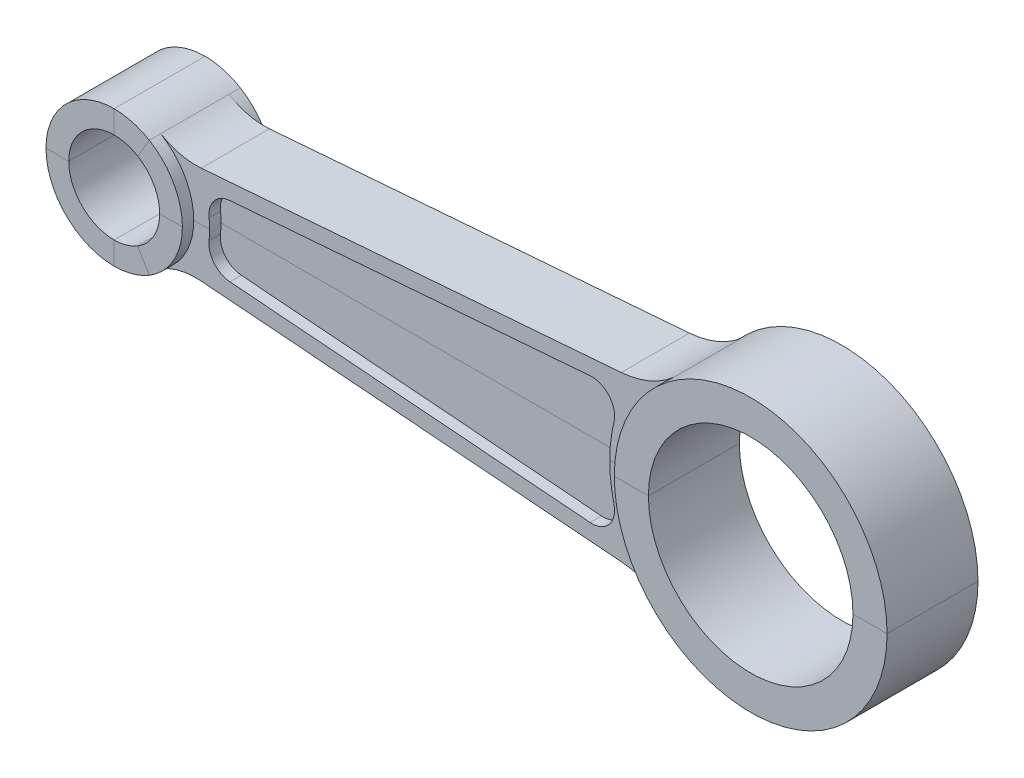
from build123d import *

# Parameters (mm, degrees)
BOSS_EXTRUDE1_DEPTH      = 19.05
BOSS_EXTRUDE1_DEPTH_BACK = 19.05
BOSS_EXTRUDE2_DEPTH      = 25.4
BOSS_EXTRUDE2_DEPTH_BACK = 25.4
SKETCH2_R                = 38.1
SKETCH2_R_2              = 25.4
BOSS_EXTRUDE3_DEPTH      = 25.4
BOSS_EXTRUDE3_DEPTH_BACK = 25.4
SKETCH3_R                = 76.2
SKETCH3_R_2              = 57.15
CUT_EXTRUDE1_DEPTH       = 6.35
CUT_EXTRUDE2_START       = -6.35
CUT_EXTRUDE2_DEPTH       = 6.35
FILLET1_R                = 12.7
FILLET2_R                = 50.8
FILLET3_R                = 38.1


with BuildPart() as part:
    # Sketch1 → Boss-Extrude1 (new, two sides: drawn at the far end of the back side and taken through both)
    with BuildSketch(Plane.XY.offset(-BOSS_EXTRUDE1_DEPTH_BACK)):
        with BuildLine():
            Line((295.834666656, 47.270973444), (27.692256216, 26.16770807))
            ThreePointArc((27.692256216, 26.16770807), (35.40257732, 14.080749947), (38.1, 0))
            ThreePointArc((38.1, 0), (35.40257732, -14.080749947), (27.692256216, -26.16770807))
            Line((27.692256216, -26.16770807), (295.834666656, -47.270973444))
            ThreePointArc((295.834666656, -47.270973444), (279.4, 0), (295.834666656, 47.270973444))
        make_face()
    extrude(amount=BOSS_EXTRUDE1_DEPTH + BOSS_EXTRUDE1_DEPTH_BACK)

    # Sketch2 → Boss-Extrude2 (add, two sides: drawn at the far end of the back side and taken through both)
    with BuildSketch(Plane.XY.offset(-BOSS_EXTRUDE2_DEPTH_BACK)):
        Circle(SKETCH2_R)
        Circle(SKETCH2_R_2, mode=Mode.SUBTRACT)
    extrude(amount=BOSS_EXTRUDE2_DEPTH + BOSS_EXTRUDE2_DEPTH_BACK)

    # Sketch3 → Boss-Extrude3 (add, two sides: drawn at the far end of the back side and taken through both)
    with BuildSketch(Plane.XY.offset(-BOSS_EXTRUDE3_DEPTH_BACK)):
        with Locations((355.6, 0)):
            Circle(SKETCH3_R)
        with Locations((355.6, 0)):
            Circle(SKETCH3_R_2, mode=Mode.SUBTRACT)
    extrude(amount=BOSS_EXTRUDE3_DEPTH + BOSS_EXTRUDE3_DEPTH_BACK)

    # Sketch4 → Cut-Extrude1 (cut)
    with BuildSketch(Plane.XY.offset(19.05)):
        with BuildLine():
            Line((278.988917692, 37.027694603), (43.207313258, 18.471279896))
            ThreePointArc((43.207313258, 18.471279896), (46.99, 0), (43.207313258, -18.471279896))
            Line((43.207313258, -18.471279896), (278.988917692, -37.027694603))
            ThreePointArc((278.988917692, -37.027694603), (270.51, 0), (278.988917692, 37.027694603))
        make_face()
    extrude(amount=-CUT_EXTRUDE1_DEPTH, mode=Mode.SUBTRACT)

    # Sketch5 → Cut-Extrude2 (cut)
    with BuildSketch(Plane(origin=(0, 0, -19.05), x_dir=(-1, 0, 0), z_dir=(0, 0, -1)).offset(CUT_EXTRUDE2_START)):
        with BuildLine():
            Line((-278.988917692, 37.027694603), (-43.207313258, 18.471279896))
            ThreePointArc((-43.207313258, 18.471279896), (-46.99, 0), (-43.207313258, -18.471279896))
            Line((-43.207313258, -18.471279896), (-278.988917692, -37.027694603))
            ThreePointArc((-278.988917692, -37.027694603), (-270.51, 0), (-278.988917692, 37.027694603))
        make_face()
    extrude(amount=CUT_EXTRUDE2_DEPTH, mode=Mode.SUBTRACT)

    # Fillet1
    fillet1_edges = [part.edges().sort_by_distance(p)[0] for p in [
        (278.988917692, 37.027694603, 15.875),
        (278.988917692, -37.027694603, 15.875),
        (43.207313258, -18.471279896, 15.875),
        (43.207313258, 18.471279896, 15.875),
        (43.207313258, 18.471279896, -15.875),
        (43.207313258, -18.471279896, -15.875),
        (278.988917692, -37.027694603, -15.875),
        (278.988917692, 37.027694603, -15.875),
    ]]
    fillet(fillet1_edges, radius=FILLET1_R)

    # Fillet2
    fillet2_edges = [part.edges().sort_by_distance(p)[0] for p in [
        (295.834666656, -47.270973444, 0),
        (295.834666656, 47.270973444, 0),
    ]]
    fillet(fillet2_edges, radius=FILLET2_R)

    # Fillet3
    fillet3_edges = [part.edges().sort_by_distance(p)[0] for p in [
        (27.692256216, -26.16770807, 0),
        (27.692256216, 26.16770807, 0),
    ]]
    fillet(fillet3_edges, radius=FILLET3_R)


solid = part.part
